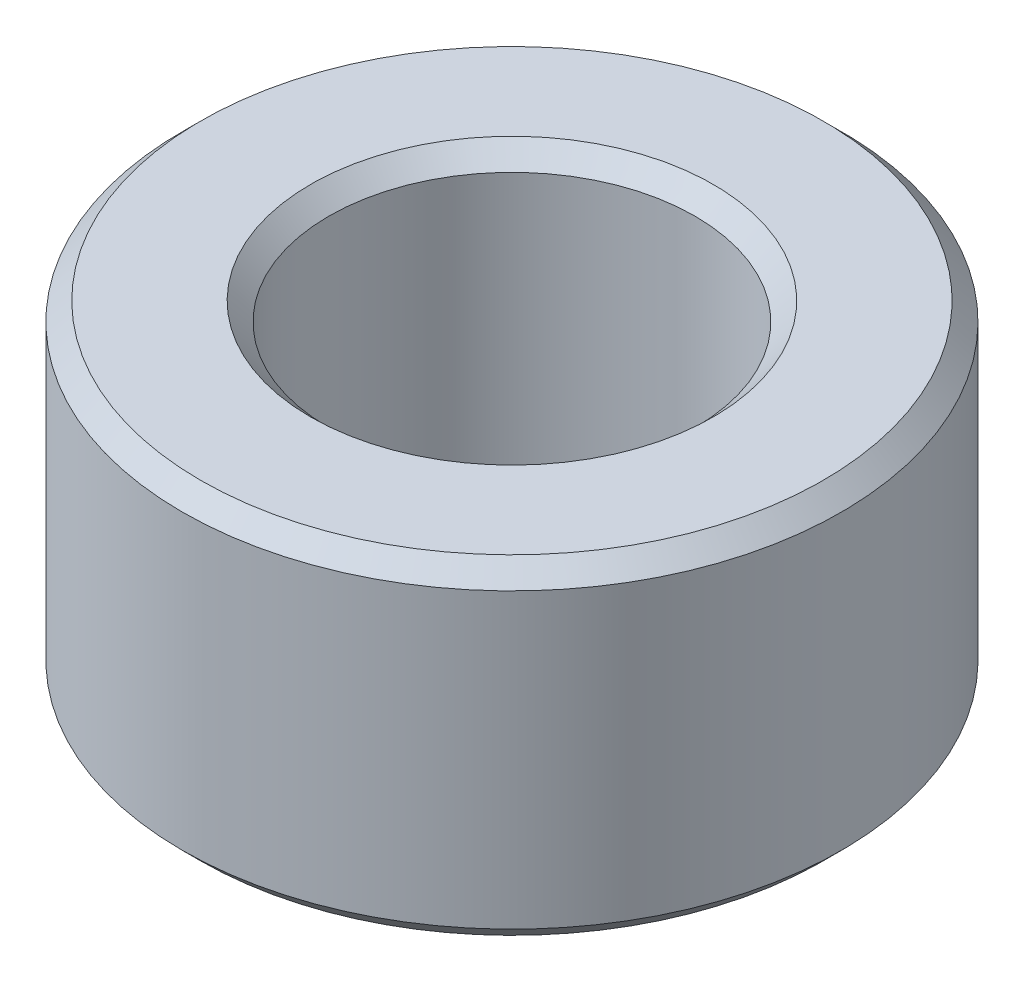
from build123d import *


with BuildPart() as part:
    # Esquisse1 → Base-R_volution (revolve)
    with BuildSketch(Plane.XY, mode=Mode.PRIVATE) as base_r_volution_sk:
        Polygon((-5.5, 0), (-8.5, 0), (-9, 0.5), (-9, 8.5), (-8.5, 9), (-5.5, 9), (-5, 8.5), (-5, 0.5), align=None)
    revolve(base_r_volution_sk.sketch.rotate(Axis((0, 40, 0), (0, -1, 0)), 270), axis=Axis((0, 40, 0), (0, -1, 0)))


solid = part.part
